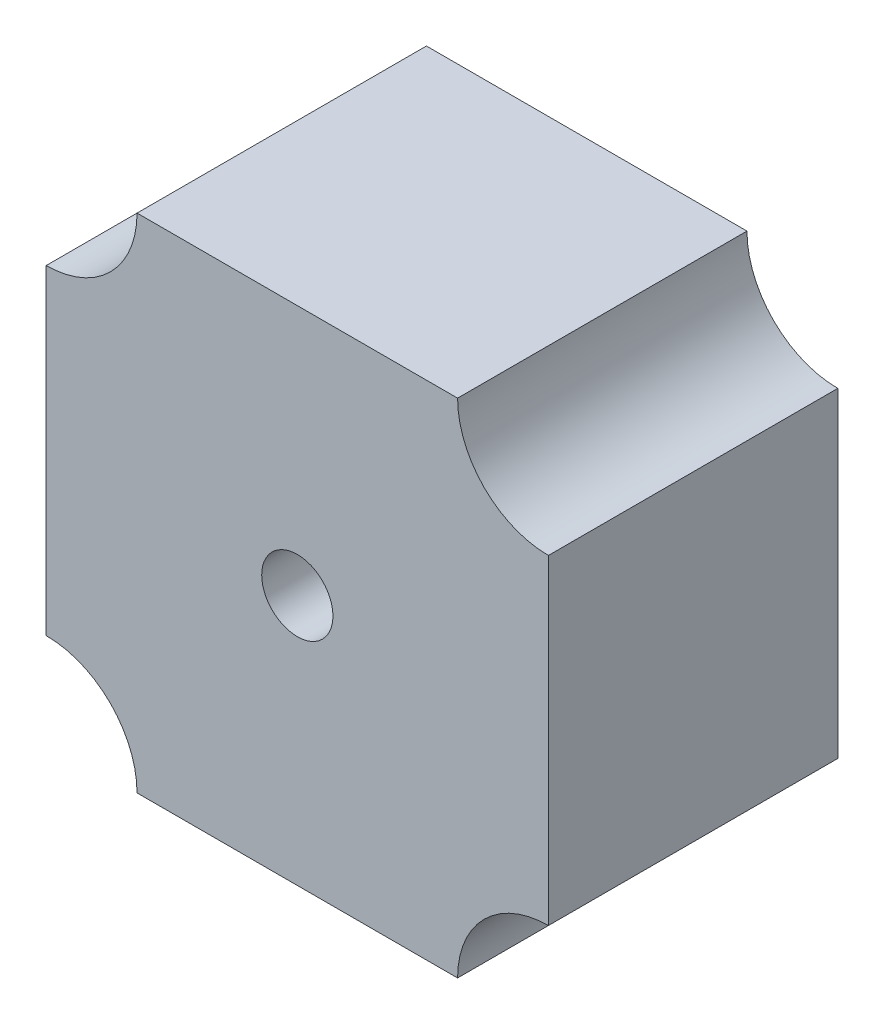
ISO-10303-21;
HEADER;
FILE_DESCRIPTION(('STEP AP214'),'2;1');
FILE_NAME('part.step','',(''),(''),'','','');
FILE_SCHEMA(('AUTOMOTIVE_DESIGN { 1 0 10303 214 1 1 1 1 }'));
ENDSEC;
DATA;
#1=APPLICATION_CONTEXT('core data for automotive mechanical design processes');
#2=APPLICATION_PROTOCOL_DEFINITION('international standard','automotive_design',2000,#1);
#3=PRODUCT_CONTEXT('',#1,'mechanical');
#4=PRODUCT('Part','Part','',(#3));
#5=PRODUCT_RELATED_PRODUCT_CATEGORY('part','',(#4));
#6=PRODUCT_DEFINITION_FORMATION('','',#4);
#7=PRODUCT_DEFINITION_CONTEXT('part definition',#1,'design');
#8=PRODUCT_DEFINITION('design','',#6,#7);
#9=PRODUCT_DEFINITION_SHAPE('','',#8);
#10=(LENGTH_UNIT() NAMED_UNIT(*) SI_UNIT(.MILLI.,.METRE.));
#11=(NAMED_UNIT(*) PLANE_ANGLE_UNIT() SI_UNIT($,.RADIAN.));
#12=(NAMED_UNIT(*) SI_UNIT($,.STERADIAN.) SOLID_ANGLE_UNIT());
#13=UNCERTAINTY_MEASURE_WITH_UNIT(LENGTH_MEASURE(1.E-05),#10,'distance_accuracy_value','');
#14=(GEOMETRIC_REPRESENTATION_CONTEXT(3) GLOBAL_UNCERTAINTY_ASSIGNED_CONTEXT((#13)) GLOBAL_UNIT_ASSIGNED_CONTEXT((#10,
#11,#12)) REPRESENTATION_CONTEXT('',''));
#15=CARTESIAN_POINT('',(0.,0.,0.));
#16=DIRECTION('',(0.,0.,1.));
#17=DIRECTION('',(1.,0.,0.));
#18=AXIS2_PLACEMENT_3D('',#15,#16,#17);
#19=CARTESIAN_POINT('',(-28.2,28.2,32.5));
#20=DIRECTION('',(0.,0.,-1.));
#21=DIRECTION('',(-1.,0.,0.));
#22=AXIS2_PLACEMENT_3D('',#19,#20,#21);
#23=CYLINDRICAL_SURFACE('',#22,10.2);
#24=CARTESIAN_POINT('',(-28.2,28.2,0.));
#25=DIRECTION('',(0.,0.,-1.));
#26=DIRECTION('',(1.,0.,0.));
#27=AXIS2_PLACEMENT_3D('',#24,#25,#26);
#28=CIRCLE('',#27,10.2);
#29=CARTESIAN_POINT('',(-18.,28.2,0.));
#30=VERTEX_POINT('',#29);
#31=CARTESIAN_POINT('',(-28.2,18.,0.));
#32=VERTEX_POINT('',#31);
#33=EDGE_CURVE('E129',#30,#32,#28,.T.);
#34=ORIENTED_EDGE('',*,*,#33,.T.);
#35=DIRECTION('',(0.,0.,-1.));
#36=VECTOR('',#35,1.);
#37=CARTESIAN_POINT('',(-28.2,18.,32.5));
#38=LINE('',#37,#36);
#39=CARTESIAN_POINT('',(-28.2,18.,32.5));
#40=VERTEX_POINT('',#39);
#41=EDGE_CURVE('E11',#40,#32,#38,.T.);
#42=ORIENTED_EDGE('',*,*,#41,.F.);
#43=CARTESIAN_POINT('',(-28.2,28.2,32.5));
#44=DIRECTION('',(0.,0.,-1.));
#45=DIRECTION('',(1.,0.,0.));
#46=AXIS2_PLACEMENT_3D('',#43,#44,#45);
#47=CIRCLE('',#46,10.2);
#48=CARTESIAN_POINT('',(-18.,28.2,32.5));
#49=VERTEX_POINT('',#48);
#50=EDGE_CURVE('E144',#49,#40,#47,.T.);
#51=ORIENTED_EDGE('',*,*,#50,.F.);
#52=DIRECTION('',(0.,0.,-1.));
#53=VECTOR('',#52,1.);
#54=CARTESIAN_POINT('',(-18.,28.2,32.5));
#55=LINE('',#54,#53);
#56=EDGE_CURVE('E125',#49,#30,#55,.T.);
#57=ORIENTED_EDGE('',*,*,#56,.T.);
#58=EDGE_LOOP('',(#34,#42,#51,#57));
#59=FACE_BOUND('',#58,.T.);
#60=ADVANCED_FACE('F33',(#59),#23,.F.);
#61=CARTESIAN_POINT('',(-28.2,-18.,32.5));
#62=DIRECTION('',(1.,0.,0.));
#63=DIRECTION('',(0.,0.,-1.));
#64=AXIS2_PLACEMENT_3D('',#61,#62,#63);
#65=PLANE('',#64);
#66=DIRECTION('',(0.,-1.,0.));
#67=VECTOR('',#66,1.);
#68=CARTESIAN_POINT('',(-28.2,-18.,0.));
#69=LINE('',#68,#67);
#70=CARTESIAN_POINT('',(-28.2,-18.,0.));
#71=VERTEX_POINT('',#70);
#72=EDGE_CURVE('E132',#32,#71,#69,.T.);
#73=ORIENTED_EDGE('',*,*,#72,.T.);
#74=DIRECTION('',(0.,0.,-1.));
#75=VECTOR('',#74,1.);
#76=CARTESIAN_POINT('',(-28.2,-18.,32.5));
#77=LINE('',#76,#75);
#78=CARTESIAN_POINT('',(-28.2,-18.,32.5));
#79=VERTEX_POINT('',#78);
#80=EDGE_CURVE('E41',#79,#71,#77,.T.);
#81=ORIENTED_EDGE('',*,*,#80,.F.);
#82=DIRECTION('',(0.,-1.,0.));
#83=VECTOR('',#82,1.);
#84=CARTESIAN_POINT('',(-28.2,-18.,32.5));
#85=LINE('',#84,#83);
#86=EDGE_CURVE('E92',#40,#79,#85,.T.);
#87=ORIENTED_EDGE('',*,*,#86,.F.);
#88=ORIENTED_EDGE('',*,*,#41,.T.);
#89=EDGE_LOOP('',(#73,#81,#87,#88));
#90=FACE_BOUND('',#89,.T.);
#91=ADVANCED_FACE('F199',(#90),#65,.F.);
#92=CARTESIAN_POINT('',(-28.2,-28.2,32.5));
#93=DIRECTION('',(0.,0.,-1.));
#94=DIRECTION('',(-1.,0.,0.));
#95=AXIS2_PLACEMENT_3D('',#92,#93,#94);
#96=CYLINDRICAL_SURFACE('',#95,10.2);
#97=CARTESIAN_POINT('',(-28.2,-28.2,0.));
#98=DIRECTION('',(0.,0.,-1.));
#99=DIRECTION('',(-1.,0.,0.));
#100=AXIS2_PLACEMENT_3D('',#97,#98,#99);
#101=CIRCLE('',#100,10.2);
#102=CARTESIAN_POINT('',(-18.,-28.2,0.));
#103=VERTEX_POINT('',#102);
#104=EDGE_CURVE('E135',#71,#103,#101,.T.);
#105=ORIENTED_EDGE('',*,*,#104,.T.);
#106=DIRECTION('',(0.,0.,-1.));
#107=VECTOR('',#106,1.);
#108=CARTESIAN_POINT('',(-18.,-28.2,32.5));
#109=LINE('',#108,#107);
#110=CARTESIAN_POINT('',(-18.,-28.2,32.5));
#111=VERTEX_POINT('',#110);
#112=EDGE_CURVE('E151',#111,#103,#109,.T.);
#113=ORIENTED_EDGE('',*,*,#112,.F.);
#114=CARTESIAN_POINT('',(-28.2,-28.2,32.5));
#115=DIRECTION('',(0.,0.,-1.));
#116=DIRECTION('',(-1.,0.,0.));
#117=AXIS2_PLACEMENT_3D('',#114,#115,#116);
#118=CIRCLE('',#117,10.2);
#119=EDGE_CURVE('E159',#79,#111,#118,.T.);
#120=ORIENTED_EDGE('',*,*,#119,.F.);
#121=ORIENTED_EDGE('',*,*,#80,.T.);
#122=EDGE_LOOP('',(#105,#113,#120,#121));
#123=FACE_BOUND('',#122,.T.);
#124=ADVANCED_FACE('F157',(#123),#96,.F.);
#125=CARTESIAN_POINT('',(18.,-28.2,32.5));
#126=DIRECTION('',(0.,1.,0.));
#127=DIRECTION('',(-1.,0.,0.));
#128=AXIS2_PLACEMENT_3D('',#125,#126,#127);
#129=PLANE('',#128);
#130=DIRECTION('',(1.,0.,0.));
#131=VECTOR('',#130,1.);
#132=CARTESIAN_POINT('',(18.,-28.2,0.));
#133=LINE('',#132,#131);
#134=CARTESIAN_POINT('',(18.,-28.2,0.));
#135=VERTEX_POINT('',#134);
#136=EDGE_CURVE('E137',#103,#135,#133,.T.);
#137=ORIENTED_EDGE('',*,*,#136,.T.);
#138=DIRECTION('',(0.,0.,-1.));
#139=VECTOR('',#138,1.);
#140=CARTESIAN_POINT('',(18.,-28.2,32.5));
#141=LINE('',#140,#139);
#142=CARTESIAN_POINT('',(18.,-28.2,32.5));
#143=VERTEX_POINT('',#142);
#144=EDGE_CURVE('E148',#143,#135,#141,.T.);
#145=ORIENTED_EDGE('',*,*,#144,.F.);
#146=DIRECTION('',(1.,0.,0.));
#147=VECTOR('',#146,1.);
#148=CARTESIAN_POINT('',(18.,-28.2,32.5));
#149=LINE('',#148,#147);
#150=EDGE_CURVE('E171',#111,#143,#149,.T.);
#151=ORIENTED_EDGE('',*,*,#150,.F.);
#152=ORIENTED_EDGE('',*,*,#112,.T.);
#153=EDGE_LOOP('',(#137,#145,#151,#152));
#154=FACE_BOUND('',#153,.T.);
#155=ADVANCED_FACE('F167',(#154),#129,.F.);
#156=CARTESIAN_POINT('',(28.2,-28.2,32.5));
#157=DIRECTION('',(0.,0.,-1.));
#158=DIRECTION('',(-1.,0.,0.));
#159=AXIS2_PLACEMENT_3D('',#156,#157,#158);
#160=CYLINDRICAL_SURFACE('',#159,10.2);
#161=CARTESIAN_POINT('',(28.2,-28.2,0.));
#162=DIRECTION('',(0.,0.,-1.));
#163=DIRECTION('',(-1.,0.,0.));
#164=AXIS2_PLACEMENT_3D('',#161,#162,#163);
#165=CIRCLE('',#164,10.2);
#166=CARTESIAN_POINT('',(28.2,-18.,0.));
#167=VERTEX_POINT('',#166);
#168=EDGE_CURVE('E139',#135,#167,#165,.T.);
#169=ORIENTED_EDGE('',*,*,#168,.T.);
#170=DIRECTION('',(0.,0.,-1.));
#171=VECTOR('',#170,1.);
#172=CARTESIAN_POINT('',(28.2,-18.,32.5));
#173=LINE('',#172,#171);
#174=CARTESIAN_POINT('',(28.2,-18.,32.5));
#175=VERTEX_POINT('',#174);
#176=EDGE_CURVE('E120',#175,#167,#173,.T.);
#177=ORIENTED_EDGE('',*,*,#176,.F.);
#178=CARTESIAN_POINT('',(28.2,-28.2,32.5));
#179=DIRECTION('',(0.,0.,-1.));
#180=DIRECTION('',(-1.,0.,0.));
#181=AXIS2_PLACEMENT_3D('',#178,#179,#180);
#182=CIRCLE('',#181,10.2);
#183=EDGE_CURVE('E111',#143,#175,#182,.T.);
#184=ORIENTED_EDGE('',*,*,#183,.F.);
#185=ORIENTED_EDGE('',*,*,#144,.T.);
#186=EDGE_LOOP('',(#169,#177,#184,#185));
#187=FACE_BOUND('',#186,.T.);
#188=ADVANCED_FACE('F170',(#187),#160,.F.);
#189=CARTESIAN_POINT('',(28.2,-18.,32.5));
#190=DIRECTION('',(-1.,0.,0.));
#191=DIRECTION('',(0.,0.,1.));
#192=AXIS2_PLACEMENT_3D('',#189,#190,#191);
#193=PLANE('',#192);
#194=DIRECTION('',(0.,1.,0.));
#195=VECTOR('',#194,1.);
#196=CARTESIAN_POINT('',(28.2,-18.,0.));
#197=LINE('',#196,#195);
#198=CARTESIAN_POINT('',(28.2,18.,0.));
#199=VERTEX_POINT('',#198);
#200=EDGE_CURVE('E119',#167,#199,#197,.T.);
#201=ORIENTED_EDGE('',*,*,#200,.T.);
#202=DIRECTION('',(0.,0.,-1.));
#203=VECTOR('',#202,1.);
#204=CARTESIAN_POINT('',(28.2,18.,32.5));
#205=LINE('',#204,#203);
#206=CARTESIAN_POINT('',(28.2,18.,32.5));
#207=VERTEX_POINT('',#206);
#208=EDGE_CURVE('E116',#207,#199,#205,.T.);
#209=ORIENTED_EDGE('',*,*,#208,.F.);
#210=DIRECTION('',(0.,1.,0.));
#211=VECTOR('',#210,1.);
#212=CARTESIAN_POINT('',(28.2,-18.,32.5));
#213=LINE('',#212,#211);
#214=EDGE_CURVE('E105',#175,#207,#213,.T.);
#215=ORIENTED_EDGE('',*,*,#214,.F.);
#216=ORIENTED_EDGE('',*,*,#176,.T.);
#217=EDGE_LOOP('',(#201,#209,#215,#216));
#218=FACE_BOUND('',#217,.T.);
#219=ADVANCED_FACE('F117',(#218),#193,.F.);
#220=CARTESIAN_POINT('',(28.2,28.2,32.5));
#221=DIRECTION('',(0.,0.,-1.));
#222=DIRECTION('',(-1.,0.,0.));
#223=AXIS2_PLACEMENT_3D('',#220,#221,#222);
#224=CYLINDRICAL_SURFACE('',#223,10.2);
#225=CARTESIAN_POINT('',(28.2,28.2,0.));
#226=DIRECTION('',(0.,0.,-1.));
#227=DIRECTION('',(1.,0.,0.));
#228=AXIS2_PLACEMENT_3D('',#225,#226,#227);
#229=CIRCLE('',#228,10.2);
#230=CARTESIAN_POINT('',(18.,28.2,0.));
#231=VERTEX_POINT('',#230);
#232=EDGE_CURVE('E78',#199,#231,#229,.T.);
#233=ORIENTED_EDGE('',*,*,#232,.T.);
#234=DIRECTION('',(0.,0.,-1.));
#235=VECTOR('',#234,1.);
#236=CARTESIAN_POINT('',(18.,28.2,32.5));
#237=LINE('',#236,#235);
#238=CARTESIAN_POINT('',(18.,28.2,32.5));
#239=VERTEX_POINT('',#238);
#240=EDGE_CURVE('E121',#239,#231,#237,.T.);
#241=ORIENTED_EDGE('',*,*,#240,.F.);
#242=CARTESIAN_POINT('',(28.2,28.2,32.5));
#243=DIRECTION('',(0.,0.,-1.));
#244=DIRECTION('',(1.,0.,0.));
#245=AXIS2_PLACEMENT_3D('',#242,#243,#244);
#246=CIRCLE('',#245,10.2);
#247=EDGE_CURVE('E109',#207,#239,#246,.T.);
#248=ORIENTED_EDGE('',*,*,#247,.F.);
#249=ORIENTED_EDGE('',*,*,#208,.T.);
#250=EDGE_LOOP('',(#233,#241,#248,#249));
#251=FACE_BOUND('',#250,.T.);
#252=ADVANCED_FACE('F123',(#251),#224,.F.);
#253=CARTESIAN_POINT('',(18.,28.2,32.5));
#254=DIRECTION('',(0.,-1.,0.));
#255=DIRECTION('',(0.,0.,-1.));
#256=AXIS2_PLACEMENT_3D('',#253,#254,#255);
#257=PLANE('',#256);
#258=DIRECTION('',(-1.,0.,0.));
#259=VECTOR('',#258,1.);
#260=CARTESIAN_POINT('',(18.,28.2,0.));
#261=LINE('',#260,#259);
#262=EDGE_CURVE('E84',#231,#30,#261,.T.);
#263=ORIENTED_EDGE('',*,*,#262,.T.);
#264=ORIENTED_EDGE('',*,*,#56,.F.);
#265=DIRECTION('',(-1.,0.,0.));
#266=VECTOR('',#265,1.);
#267=CARTESIAN_POINT('',(18.,28.2,32.5));
#268=LINE('',#267,#266);
#269=EDGE_CURVE('E49',#239,#49,#268,.T.);
#270=ORIENTED_EDGE('',*,*,#269,.F.);
#271=ORIENTED_EDGE('',*,*,#240,.T.);
#272=EDGE_LOOP('',(#263,#264,#270,#271));
#273=FACE_BOUND('',#272,.T.);
#274=ADVANCED_FACE('F195',(#273),#257,.F.);
#275=CARTESIAN_POINT('',(-28.2,28.2,32.5));
#276=DIRECTION('',(0.,0.,1.));
#277=DIRECTION('',(1.,0.,0.));
#278=AXIS2_PLACEMENT_3D('',#275,#276,#277);
#279=PLANE('',#278);
#280=CARTESIAN_POINT('',(0.,0.,32.5));
#281=DIRECTION('',(0.,0.,-1.));
#282=DIRECTION('',(-1.,0.,0.));
#283=AXIS2_PLACEMENT_3D('',#280,#281,#282);
#284=CIRCLE('',#283,4.);
#285=CARTESIAN_POINT('',(-4.,0.,32.5));
#286=VERTEX_POINT('',#285);
#287=EDGE_CURVE('E133',#286,#286,#284,.T.);
#288=ORIENTED_EDGE('',*,*,#287,.T.);
#289=EDGE_LOOP('',(#288));
#290=FACE_BOUND('',#289,.T.);
#291=ORIENTED_EDGE('',*,*,#50,.T.);
#292=ORIENTED_EDGE('',*,*,#86,.T.);
#293=ORIENTED_EDGE('',*,*,#119,.T.);
#294=ORIENTED_EDGE('',*,*,#150,.T.);
#295=ORIENTED_EDGE('',*,*,#183,.T.);
#296=ORIENTED_EDGE('',*,*,#214,.T.);
#297=ORIENTED_EDGE('',*,*,#247,.T.);
#298=ORIENTED_EDGE('',*,*,#269,.T.);
#299=EDGE_LOOP('',(#291,#292,#293,#294,#295,#296,#297,#298));
#300=FACE_BOUND('',#299,.T.);
#301=ADVANCED_FACE('F107',(#290,#300),#279,.T.);
#302=CARTESIAN_POINT('',(-28.2,28.2,0.));
#303=DIRECTION('',(0.,0.,1.));
#304=DIRECTION('',(1.,0.,0.));
#305=AXIS2_PLACEMENT_3D('',#302,#303,#304);
#306=PLANE('',#305);
#307=CARTESIAN_POINT('',(0.,0.,0.));
#308=DIRECTION('',(0.,0.,-1.));
#309=DIRECTION('',(-1.,0.,0.));
#310=AXIS2_PLACEMENT_3D('',#307,#308,#309);
#311=CIRCLE('',#310,4.);
#312=CARTESIAN_POINT('',(-4.,0.,0.));
#313=VERTEX_POINT('',#312);
#314=EDGE_CURVE('E177',#313,#313,#311,.T.);
#315=ORIENTED_EDGE('',*,*,#314,.F.);
#316=EDGE_LOOP('',(#315));
#317=FACE_BOUND('',#316,.T.);
#318=ORIENTED_EDGE('',*,*,#33,.F.);
#319=ORIENTED_EDGE('',*,*,#262,.F.);
#320=ORIENTED_EDGE('',*,*,#232,.F.);
#321=ORIENTED_EDGE('',*,*,#200,.F.);
#322=ORIENTED_EDGE('',*,*,#168,.F.);
#323=ORIENTED_EDGE('',*,*,#136,.F.);
#324=ORIENTED_EDGE('',*,*,#104,.F.);
#325=ORIENTED_EDGE('',*,*,#72,.F.);
#326=EDGE_LOOP('',(#318,#319,#320,#321,#322,#323,#324,#325));
#327=FACE_BOUND('',#326,.T.);
#328=ADVANCED_FACE('F163',(#317,#327),#306,.F.);
#329=CARTESIAN_POINT('',(0.,0.,32.5));
#330=DIRECTION('',(0.,0.,-1.));
#331=DIRECTION('',(-1.,0.,0.));
#332=AXIS2_PLACEMENT_3D('',#329,#330,#331);
#333=CYLINDRICAL_SURFACE('',#332,4.);
#334=ORIENTED_EDGE('',*,*,#287,.F.);
#335=EDGE_LOOP('',(#334));
#336=FACE_BOUND('',#335,.T.);
#337=ORIENTED_EDGE('',*,*,#314,.T.);
#338=EDGE_LOOP('',(#337));
#339=FACE_BOUND('',#338,.T.);
#340=ADVANCED_FACE('F184',(#336,#339),#333,.F.);
#341=CLOSED_SHELL('',(#60,#91,#124,#155,#188,#219,#252,#274,#301,#328,#340));
#342=MANIFOLD_SOLID_BREP('B2',#341);
#343=ADVANCED_BREP_SHAPE_REPRESENTATION('',(#18,#342),#14);
#344=SHAPE_DEFINITION_REPRESENTATION(#9,#343);
ENDSEC;
END-ISO-10303-21;
